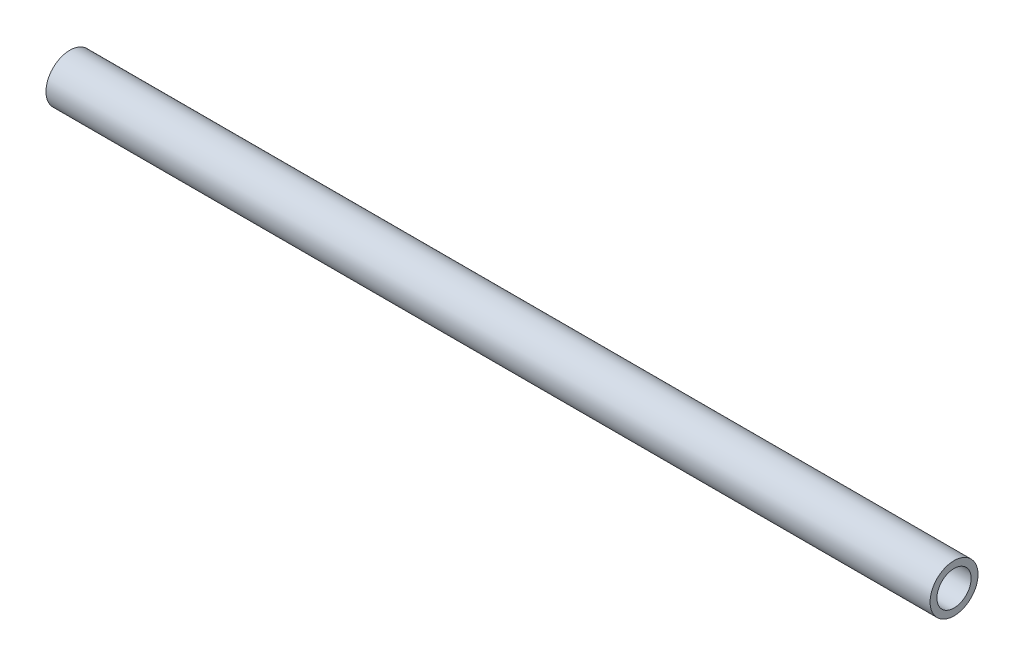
ISO-10303-21;
HEADER;
FILE_DESCRIPTION(('STEP AP214'),'2;1');
FILE_NAME('part.step','',(''),(''),'','','');
FILE_SCHEMA(('AUTOMOTIVE_DESIGN { 1 0 10303 214 1 1 1 1 }'));
ENDSEC;
DATA;
#1=APPLICATION_CONTEXT('core data for automotive mechanical design processes');
#2=APPLICATION_PROTOCOL_DEFINITION('international standard','automotive_design',2000,#1);
#3=PRODUCT_CONTEXT('',#1,'mechanical');
#4=PRODUCT('Part','Part','',(#3));
#5=PRODUCT_RELATED_PRODUCT_CATEGORY('part','',(#4));
#6=PRODUCT_DEFINITION_FORMATION('','',#4);
#7=PRODUCT_DEFINITION_CONTEXT('part definition',#1,'design');
#8=PRODUCT_DEFINITION('design','',#6,#7);
#9=PRODUCT_DEFINITION_SHAPE('','',#8);
#10=(LENGTH_UNIT() NAMED_UNIT(*) SI_UNIT(.MILLI.,.METRE.));
#11=(NAMED_UNIT(*) PLANE_ANGLE_UNIT() SI_UNIT($,.RADIAN.));
#12=(NAMED_UNIT(*) SI_UNIT($,.STERADIAN.) SOLID_ANGLE_UNIT());
#13=UNCERTAINTY_MEASURE_WITH_UNIT(LENGTH_MEASURE(1.E-05),#10,'distance_accuracy_value','');
#14=(GEOMETRIC_REPRESENTATION_CONTEXT(3) GLOBAL_UNCERTAINTY_ASSIGNED_CONTEXT((#13)) GLOBAL_UNIT_ASSIGNED_CONTEXT((#10,
#11,#12)) REPRESENTATION_CONTEXT('',''));
#15=CARTESIAN_POINT('',(0.,0.,0.));
#16=DIRECTION('',(0.,0.,1.));
#17=DIRECTION('',(1.,0.,0.));
#18=AXIS2_PLACEMENT_3D('',#15,#16,#17);
#19=CARTESIAN_POINT('',(393.7,0.,0.));
#20=DIRECTION('',(-1.,0.,0.));
#21=DIRECTION('',(0.,0.,1.));
#22=AXIS2_PLACEMENT_3D('',#19,#20,#21);
#23=CYLINDRICAL_SURFACE('',#22,7.62);
#24=CARTESIAN_POINT('',(393.7,0.,0.));
#25=DIRECTION('',(1.,0.,0.));
#26=DIRECTION('',(0.,0.,-1.));
#27=AXIS2_PLACEMENT_3D('',#24,#25,#26);
#28=CIRCLE('',#27,7.62);
#29=CARTESIAN_POINT('',(393.7,0.,-7.62));
#30=VERTEX_POINT('',#29);
#31=EDGE_CURVE('E53',#30,#30,#28,.T.);
#32=ORIENTED_EDGE('',*,*,#31,.T.);
#33=EDGE_LOOP('',(#32));
#34=FACE_BOUND('',#33,.T.);
#35=CARTESIAN_POINT('',(0.,0.,0.));
#36=DIRECTION('',(1.,0.,0.));
#37=DIRECTION('',(0.,0.,-1.));
#38=AXIS2_PLACEMENT_3D('',#35,#36,#37);
#39=CIRCLE('',#38,7.62);
#40=CARTESIAN_POINT('',(0.,0.,-7.62));
#41=VERTEX_POINT('',#40);
#42=EDGE_CURVE('E60',#41,#41,#39,.T.);
#43=ORIENTED_EDGE('',*,*,#42,.F.);
#44=EDGE_LOOP('',(#43));
#45=FACE_BOUND('',#44,.T.);
#46=ADVANCED_FACE('F45',(#34,#45),#23,.F.);
#47=CARTESIAN_POINT('',(393.7,0.,0.));
#48=DIRECTION('',(-1.,0.,0.));
#49=DIRECTION('',(0.,0.,1.));
#50=AXIS2_PLACEMENT_3D('',#47,#48,#49);
#51=CYLINDRICAL_SURFACE('',#50,10.668);
#52=CARTESIAN_POINT('',(393.7,0.,0.));
#53=DIRECTION('',(1.,0.,0.));
#54=DIRECTION('',(0.,0.,-1.));
#55=AXIS2_PLACEMENT_3D('',#52,#53,#54);
#56=CIRCLE('',#55,10.668);
#57=CARTESIAN_POINT('',(393.7,0.,-10.668));
#58=VERTEX_POINT('',#57);
#59=EDGE_CURVE('E10',#58,#58,#56,.T.);
#60=ORIENTED_EDGE('',*,*,#59,.F.);
#61=EDGE_LOOP('',(#60));
#62=FACE_BOUND('',#61,.T.);
#63=CARTESIAN_POINT('',(0.,0.,0.));
#64=DIRECTION('',(1.,0.,0.));
#65=DIRECTION('',(0.,0.,-1.));
#66=AXIS2_PLACEMENT_3D('',#63,#64,#65);
#67=CIRCLE('',#66,10.668);
#68=CARTESIAN_POINT('',(0.,0.,-10.668));
#69=VERTEX_POINT('',#68);
#70=EDGE_CURVE('E48',#69,#69,#67,.T.);
#71=ORIENTED_EDGE('',*,*,#70,.T.);
#72=EDGE_LOOP('',(#71));
#73=FACE_BOUND('',#72,.T.);
#74=ADVANCED_FACE('F69',(#62,#73),#51,.T.);
#75=CARTESIAN_POINT('',(393.7,0.,0.));
#76=DIRECTION('',(1.,0.,0.));
#77=DIRECTION('',(0.,0.,-1.));
#78=AXIS2_PLACEMENT_3D('',#75,#76,#77);
#79=PLANE('',#78);
#80=ORIENTED_EDGE('',*,*,#31,.F.);
#81=EDGE_LOOP('',(#80));
#82=FACE_BOUND('',#81,.T.);
#83=ORIENTED_EDGE('',*,*,#59,.T.);
#84=EDGE_LOOP('',(#83));
#85=FACE_BOUND('',#84,.T.);
#86=ADVANCED_FACE('F73',(#82,#85),#79,.T.);
#87=CARTESIAN_POINT('',(0.,0.,0.));
#88=DIRECTION('',(1.,0.,0.));
#89=DIRECTION('',(0.,0.,-1.));
#90=AXIS2_PLACEMENT_3D('',#87,#88,#89);
#91=PLANE('',#90);
#92=ORIENTED_EDGE('',*,*,#42,.T.);
#93=EDGE_LOOP('',(#92));
#94=FACE_BOUND('',#93,.T.);
#95=ORIENTED_EDGE('',*,*,#70,.F.);
#96=EDGE_LOOP('',(#95));
#97=FACE_BOUND('',#96,.T.);
#98=ADVANCED_FACE('F71',(#94,#97),#91,.F.);
#99=CLOSED_SHELL('',(#46,#74,#86,#98));
#100=MANIFOLD_SOLID_BREP('B2',#99);
#101=ADVANCED_BREP_SHAPE_REPRESENTATION('',(#18,#100),#14);
#102=SHAPE_DEFINITION_REPRESENTATION(#9,#101);
ENDSEC;
END-ISO-10303-21;
